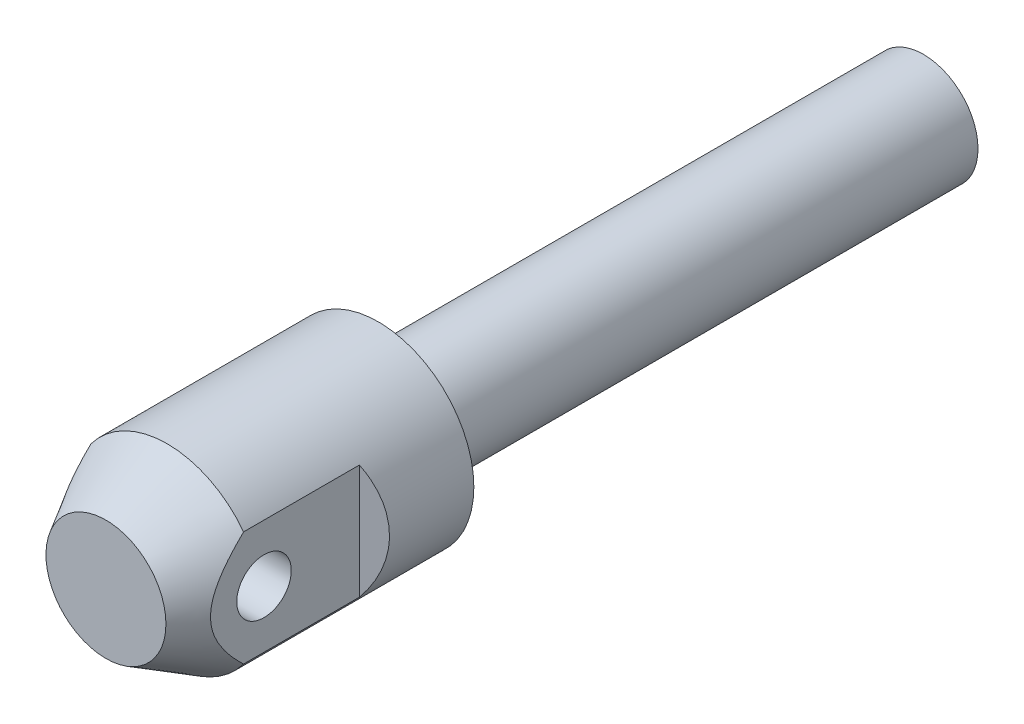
ISO-10303-21;
HEADER;
FILE_DESCRIPTION(('STEP AP214'),'2;1');
FILE_NAME('part.step','',(''),(''),'','','');
FILE_SCHEMA(('AUTOMOTIVE_DESIGN { 1 0 10303 214 1 1 1 1 }'));
ENDSEC;
DATA;
#1=APPLICATION_CONTEXT('core data for automotive mechanical design processes');
#2=APPLICATION_PROTOCOL_DEFINITION('international standard','automotive_design',2000,#1);
#3=PRODUCT_CONTEXT('',#1,'mechanical');
#4=PRODUCT('Part','Part','',(#3));
#5=PRODUCT_RELATED_PRODUCT_CATEGORY('part','',(#4));
#6=PRODUCT_DEFINITION_FORMATION('','',#4);
#7=PRODUCT_DEFINITION_CONTEXT('part definition',#1,'design');
#8=PRODUCT_DEFINITION('design','',#6,#7);
#9=PRODUCT_DEFINITION_SHAPE('','',#8);
#10=(LENGTH_UNIT() NAMED_UNIT(*) SI_UNIT(.MILLI.,.METRE.));
#11=(NAMED_UNIT(*) PLANE_ANGLE_UNIT() SI_UNIT($,.RADIAN.));
#12=(NAMED_UNIT(*) SI_UNIT($,.STERADIAN.) SOLID_ANGLE_UNIT());
#13=UNCERTAINTY_MEASURE_WITH_UNIT(LENGTH_MEASURE(1.E-05),#10,'distance_accuracy_value','');
#14=(GEOMETRIC_REPRESENTATION_CONTEXT(3) GLOBAL_UNCERTAINTY_ASSIGNED_CONTEXT((#13)) GLOBAL_UNIT_ASSIGNED_CONTEXT((#10,
#11,#12)) REPRESENTATION_CONTEXT('',''));
#15=CARTESIAN_POINT('',(0.,0.,0.));
#16=DIRECTION('',(0.,0.,1.));
#17=DIRECTION('',(1.,0.,0.));
#18=AXIS2_PLACEMENT_3D('',#15,#16,#17);
#19=CARTESIAN_POINT('',(0.,0.,20.));
#20=DIRECTION('',(0.,0.,1.));
#21=DIRECTION('',(1.,0.,0.));
#22=AXIS2_PLACEMENT_3D('',#19,#20,#21);
#23=CYLINDRICAL_SURFACE('',#22,4.);
#24=CARTESIAN_POINT('',(0.,0.,0.));
#25=DIRECTION('',(0.,0.,1.));
#26=DIRECTION('',(1.,0.,0.));
#27=AXIS2_PLACEMENT_3D('',#24,#25,#26);
#28=CIRCLE('',#27,4.);
#29=CARTESIAN_POINT('',(4.,0.,0.));
#30=VERTEX_POINT('',#29);
#31=EDGE_CURVE('E86',#30,#30,#28,.T.);
#32=ORIENTED_EDGE('',*,*,#31,.F.);
#33=EDGE_LOOP('',(#32));
#34=FACE_BOUND('',#33,.T.);
#35=CARTESIAN_POINT('',(0.,0.,-40.));
#36=DIRECTION('',(0.,0.,-1.));
#37=DIRECTION('',(-1.,0.,0.));
#38=AXIS2_PLACEMENT_3D('',#35,#36,#37);
#39=CIRCLE('',#38,4.);
#40=CARTESIAN_POINT('',(-4.,0.,-40.));
#41=VERTEX_POINT('',#40);
#42=EDGE_CURVE('E146',#41,#41,#39,.T.);
#43=ORIENTED_EDGE('',*,*,#42,.F.);
#44=EDGE_LOOP('',(#43));
#45=FACE_BOUND('',#44,.T.);
#46=ADVANCED_FACE('F14',(#34,#45),#23,.T.);
#47=CARTESIAN_POINT('',(0.,0.,20.));
#48=DIRECTION('',(0.,0.,1.));
#49=DIRECTION('',(1.,0.,0.));
#50=AXIS2_PLACEMENT_3D('',#47,#48,#49);
#51=CYLINDRICAL_SURFACE('',#50,7.);
#52=CARTESIAN_POINT('',(0.,0.,0.));
#53=DIRECTION('',(0.,0.,1.));
#54=DIRECTION('',(1.,0.,0.));
#55=AXIS2_PLACEMENT_3D('',#52,#53,#54);
#56=CIRCLE('',#55,7.);
#57=CARTESIAN_POINT('',(7.,0.,0.));
#58=VERTEX_POINT('',#57);
#59=EDGE_CURVE('E83',#58,#58,#56,.T.);
#60=ORIENTED_EDGE('',*,*,#59,.T.);
#61=EDGE_LOOP('',(#60));
#62=FACE_BOUND('',#61,.T.);
#63=CARTESIAN_POINT('',(0.,0.,15.5));
#64=DIRECTION('',(0.,0.,1.));
#65=DIRECTION('',(1.,0.,0.));
#66=AXIS2_PLACEMENT_3D('',#63,#64,#65);
#67=CIRCLE('',#66,7.);
#68=CARTESIAN_POINT('',(-5.6,-4.2,15.5));
#69=VERTEX_POINT('',#68);
#70=CARTESIAN_POINT('',(5.6,-4.2,15.5));
#71=VERTEX_POINT('',#70);
#72=EDGE_CURVE('E68',#69,#71,#67,.T.);
#73=ORIENTED_EDGE('',*,*,#72,.F.);
#74=DIRECTION('',(0.,0.,1.));
#75=VECTOR('',#74,1.);
#76=CARTESIAN_POINT('',(-5.6,-4.2,20.));
#77=LINE('',#76,#75);
#78=CARTESIAN_POINT('',(-5.6,-4.2,7.));
#79=VERTEX_POINT('',#78);
#80=EDGE_CURVE('E30',#69,#79,#77,.F.);
#81=ORIENTED_EDGE('',*,*,#80,.T.);
#82=CARTESIAN_POINT('',(0.,0.,10.2331615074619));
#83=DIRECTION('',(0.5,0.,-0.866025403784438));
#84=DIRECTION('',(0.866025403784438,0.,0.5));
#85=AXIS2_PLACEMENT_3D('',#82,#83,#84);
#86=ELLIPSE('',#85,8.08290376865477,7.);
#87=CARTESIAN_POINT('',(-5.6,4.2,7.));
#88=VERTEX_POINT('',#87);
#89=EDGE_CURVE('E9',#88,#79,#86,.F.);
#90=ORIENTED_EDGE('',*,*,#89,.F.);
#91=DIRECTION('',(0.,0.,1.));
#92=VECTOR('',#91,1.);
#93=CARTESIAN_POINT('',(-5.6,4.2,20.));
#94=LINE('',#93,#92);
#95=CARTESIAN_POINT('',(-5.6,4.2,15.5));
#96=VERTEX_POINT('',#95);
#97=EDGE_CURVE('E63',#88,#96,#94,.T.);
#98=ORIENTED_EDGE('',*,*,#97,.T.);
#99=CARTESIAN_POINT('',(5.6,4.2,15.5));
#100=VERTEX_POINT('',#99);
#101=EDGE_CURVE('E80',#100,#96,#67,.T.);
#102=ORIENTED_EDGE('',*,*,#101,.F.);
#103=DIRECTION('',(0.,0.,1.));
#104=VECTOR('',#103,1.);
#105=CARTESIAN_POINT('',(5.6,4.2,20.));
#106=LINE('',#105,#104);
#107=CARTESIAN_POINT('',(5.6,4.2,7.));
#108=VERTEX_POINT('',#107);
#109=EDGE_CURVE('E38',#108,#100,#106,.T.);
#110=ORIENTED_EDGE('',*,*,#109,.F.);
#111=CARTESIAN_POINT('',(0.,0.,10.2331615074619));
#112=DIRECTION('',(0.5,0.,0.866025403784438));
#113=DIRECTION('',(-0.866025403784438,0.,0.5));
#114=AXIS2_PLACEMENT_3D('',#111,#112,#113);
#115=ELLIPSE('',#114,8.08290376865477,7.);
#116=CARTESIAN_POINT('',(5.6,-4.2,7.));
#117=VERTEX_POINT('',#116);
#118=EDGE_CURVE('E97',#108,#117,#115,.F.);
#119=ORIENTED_EDGE('',*,*,#118,.T.);
#120=DIRECTION('',(0.,0.,1.));
#121=VECTOR('',#120,1.);
#122=CARTESIAN_POINT('',(5.6,-4.2,20.));
#123=LINE('',#122,#121);
#124=EDGE_CURVE('E75',#71,#117,#123,.F.);
#125=ORIENTED_EDGE('',*,*,#124,.F.);
#126=EDGE_LOOP('',(#73,#81,#90,#98,#102,#110,#119,#125));
#127=FACE_BOUND('',#126,.T.);
#128=ADVANCED_FACE('F66',(#62,#127),#51,.T.);
#129=CARTESIAN_POINT('',(0.,0.,20.));
#130=DIRECTION('',(0.,0.,-1.));
#131=DIRECTION('',(-1.,0.,0.));
#132=AXIS2_PLACEMENT_3D('',#129,#130,#131);
#133=CONICAL_SURFACE('',#132,4.40192378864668,0.523598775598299);
#134=CARTESIAN_POINT('',(0.,0.,20.));
#135=DIRECTION('',(0.,0.,1.));
#136=DIRECTION('',(1.,0.,0.));
#137=AXIS2_PLACEMENT_3D('',#134,#135,#136);
#138=CIRCLE('',#137,4.40192378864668);
#139=CARTESIAN_POINT('',(4.40192378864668,0.,20.));
#140=VERTEX_POINT('',#139);
#141=EDGE_CURVE('E77',#140,#140,#138,.T.);
#142=ORIENTED_EDGE('',*,*,#141,.F.);
#143=EDGE_LOOP('',(#142));
#144=FACE_BOUND('',#143,.T.);
#145=ORIENTED_EDGE('',*,*,#101,.T.);
#146=CARTESIAN_POINT('',(-5.6,-9.70053111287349,8.22381670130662));
#147=CARTESIAN_POINT('',(-5.6,-9.49292045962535,8.5351881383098));
#148=CARTESIAN_POINT('',(-5.6,-9.28419996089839,8.84582722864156));
#149=CARTESIAN_POINT('',(-5.6,-8.86396448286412,9.46526615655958));
#150=CARTESIAN_POINT('',(-5.6,-8.65244914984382,9.77406575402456));
#151=CARTESIAN_POINT('',(-5.6,-8.22496318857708,10.3910148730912));
#152=CARTESIAN_POINT('',(-5.6,-8.00897479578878,10.6991521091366));
#153=CARTESIAN_POINT('',(-5.6,-7.57288894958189,11.3124800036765));
#154=CARTESIAN_POINT('',(-5.6,-7.35279177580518,11.6176708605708));
#155=CARTESIAN_POINT('',(-5.6,-6.8924160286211,12.2447764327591));
#156=CARTESIAN_POINT('',(-5.6,-6.65177850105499,12.5664282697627));
#157=CARTESIAN_POINT('',(-5.6,-6.16295581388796,13.2039478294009));
#158=CARTESIAN_POINT('',(-5.6,-5.91477123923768,13.5198159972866));
#159=CARTESIAN_POINT('',(-5.6,-5.53523821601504,13.9871600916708));
#160=CARTESIAN_POINT('',(-5.6,-5.4076614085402,14.1416995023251));
#161=CARTESIAN_POINT('',(-5.6,-5.14958306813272,14.4483127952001));
#162=CARTESIAN_POINT('',(-5.6,-5.01908165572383,14.6003867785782));
#163=CARTESIAN_POINT('',(-5.6,-4.75469946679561,14.901472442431));
#164=CARTESIAN_POINT('',(-5.6,-4.62081999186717,15.0504852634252));
#165=CARTESIAN_POINT('',(-5.6,-4.34902251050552,15.3447710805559));
#166=CARTESIAN_POINT('',(-5.6,-4.21110494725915,15.4900444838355));
#167=CARTESIAN_POINT('',(-5.6,-3.99488885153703,15.7102406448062));
#168=CARTESIAN_POINT('',(-5.6,-3.91829370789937,15.7868367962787));
#169=CARTESIAN_POINT('',(-5.6,-3.76354640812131,15.9384393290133));
#170=CARTESIAN_POINT('',(-5.6,-3.68539423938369,16.0134456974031));
#171=CARTESIAN_POINT('',(-5.6,-3.44829101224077,16.2358094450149));
#172=CARTESIAN_POINT('',(-5.6,-3.28675601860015,16.380446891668));
#173=CARTESIAN_POINT('',(-5.6,-2.9565917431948,16.6588481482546));
#174=CARTESIAN_POINT('',(-5.6,-2.78802551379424,16.7926860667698));
#175=CARTESIAN_POINT('',(-5.6,-2.44109766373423,17.0468872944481));
#176=CARTESIAN_POINT('',(-5.6,-2.2627447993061,17.1672623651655));
#177=CARTESIAN_POINT('',(-5.6,-1.89093357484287,17.3913766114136));
#178=CARTESIAN_POINT('',(-5.6,-1.6972496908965,17.4947487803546));
#179=CARTESIAN_POINT('',(-5.6,-1.29711098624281,17.6736591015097));
#180=CARTESIAN_POINT('',(-5.6,-1.09067068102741,17.7492282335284));
#181=CARTESIAN_POINT('',(-5.6,-0.771838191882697,17.8349092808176));
#182=CARTESIAN_POINT('',(-5.6,-0.663134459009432,17.8589345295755));
#183=CARTESIAN_POINT('',(-5.6,-0.443873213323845,17.896280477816));
#184=CARTESIAN_POINT('',(-5.6,-0.333315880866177,17.909602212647));
#185=CARTESIAN_POINT('',(-5.6,-0.111521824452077,17.9248452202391));
#186=CARTESIAN_POINT('',(-5.6,-0.000285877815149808,17.926777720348));
#187=CARTESIAN_POINT('',(-5.6,0.221787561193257,17.9191711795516));
#188=CARTESIAN_POINT('',(-5.6,0.332625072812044,17.909632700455));
#189=CARTESIAN_POINT('',(-5.6,0.535708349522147,17.8819165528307));
#190=CARTESIAN_POINT('',(-5.6,0.628173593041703,17.8653066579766));
#191=CARTESIAN_POINT('',(-5.6,0.811513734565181,17.8248234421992));
#192=CARTESIAN_POINT('',(-5.6,0.902388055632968,17.8009475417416));
#193=CARTESIAN_POINT('',(-5.6,1.17202420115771,17.7194541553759));
#194=CARTESIAN_POINT('',(-5.6,1.34784342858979,17.6519643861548));
#195=CARTESIAN_POINT('',(-5.6,1.67656021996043,17.5029518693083));
#196=CARTESIAN_POINT('',(-5.6,1.83017318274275,17.422949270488));
#197=CARTESIAN_POINT('',(-5.6,2.1299433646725,17.2498642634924));
#198=CARTESIAN_POINT('',(-5.6,2.27609383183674,17.1567702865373));
#199=CARTESIAN_POINT('',(-5.6,2.56307158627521,16.9596775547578));
#200=CARTESIAN_POINT('',(-5.6,2.70382542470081,16.8555730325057));
#201=CARTESIAN_POINT('',(-5.6,2.91036000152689,16.6936954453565));
#202=CARTESIAN_POINT('',(-5.6,2.97842504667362,16.6387948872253));
#203=CARTESIAN_POINT('',(-5.6,3.11315281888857,16.5272996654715));
#204=CARTESIAN_POINT('',(-5.6,3.17981556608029,16.4707050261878));
#205=CARTESIAN_POINT('',(-5.6,3.37644695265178,16.2999211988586));
#206=CARTESIAN_POINT('',(-5.6,3.5045338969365,16.1835625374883));
#207=CARTESIAN_POINT('',(-5.6,3.75639629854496,15.9462534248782));
#208=CARTESIAN_POINT('',(-5.6,3.88017091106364,15.8253020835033));
#209=CARTESIAN_POINT('',(-5.6,4.12409751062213,15.5796482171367));
#210=CARTESIAN_POINT('',(-5.6,4.24424700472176,15.4549432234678));
#211=CARTESIAN_POINT('',(-5.6,4.481361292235,15.2025354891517));
#212=CARTESIAN_POINT('',(-5.6,4.59832585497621,15.0748325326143));
#213=CARTESIAN_POINT('',(-5.6,4.94596827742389,14.6870890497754));
#214=CARTESIAN_POINT('',(-5.6,5.17249967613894,14.423330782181));
#215=CARTESIAN_POINT('',(-5.6,5.61723114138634,13.8888834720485));
#216=CARTESIAN_POINT('',(-5.6,5.83543008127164,13.6181935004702));
#217=CARTESIAN_POINT('',(-5.6,6.14849079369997,13.2202386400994));
#218=CARTESIAN_POINT('',(-5.6,6.24592735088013,13.0949881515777));
#219=CARTESIAN_POINT('',(-5.6,6.43957396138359,12.8435571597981));
#220=CARTESIAN_POINT('',(-5.6,6.53578410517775,12.7173767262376));
#221=CARTESIAN_POINT('',(-5.6,6.8228015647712,12.3375613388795));
#222=CARTESIAN_POINT('',(-5.6,7.01196911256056,12.082686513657));
#223=CARTESIAN_POINT('',(-5.6,7.38506026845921,11.572617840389));
#224=CARTESIAN_POINT('',(-5.6,7.56901560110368,11.3174471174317));
#225=CARTESIAN_POINT('',(-5.6,7.93394479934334,10.8050609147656));
#226=CARTESIAN_POINT('',(-5.6,8.11491927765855,10.547845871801));
#227=CARTESIAN_POINT('',(-5.6,8.29470524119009,10.2898119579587));
#228=B_SPLINE_CURVE_WITH_KNOTS('',3,(#146,#147,#148,#149,#150,#151,#152,#153,#154,#155,#156,
#157,#158,#159,#160,#161,#162,#163,#164,#165,#166,#167,#168,#169,#170,#171,#172,#173,#174,#175,
#176,#177,#178,#179,#180,#181,#182,#183,#184,#185,#186,#187,#188,#189,#190,#191,#192,#193,#194,
#195,#196,#197,#198,#199,#200,#201,#202,#203,#204,#205,#206,#207,#208,#209,#210,#211,#212,#213,
#214,#215,#216,#217,#218,#219,#220,#221,#222,#223,#224,#225,#226,#227),.UNSPECIFIED.,.F.,.F.,(4,
2,2,2,2,2,2,2,2,2,2,2,2,2,2,2,2,2,2,2,2,2,2,2,2,2,2,2,2,2,2,2,2,2,2,2,2,2,2,2,4),(0.,
1.12272226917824,2.24558801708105,3.37445229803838,4.50324002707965,5.70827682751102,
6.91322046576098,7.5143780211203,8.11551084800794,8.71641548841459,9.31725442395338,
9.64220147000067,9.96715114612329,10.6173204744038,11.2625617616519,11.9072348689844,
12.5643833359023,13.2207973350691,13.5543256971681,13.8878217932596,14.2209890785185,
14.5541400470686,14.8356659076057,15.1172918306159,15.6804109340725,16.1992641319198,
16.7185787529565,17.2434351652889,17.5057534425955,17.7680679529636,18.2870550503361,
18.8061432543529,19.3255806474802,19.8450555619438,20.8878460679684,21.9307770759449,
22.4068321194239,22.8828518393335,23.835021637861,24.7786980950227,25.7221780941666),.UNSPECIFIED.);
#229=EDGE_CURVE('E23',#96,#69,#228,.F.);
#230=ORIENTED_EDGE('',*,*,#229,.T.);
#231=ORIENTED_EDGE('',*,*,#72,.T.);
#232=CARTESIAN_POINT('',(5.6,-9.70053111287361,8.22381670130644));
#233=CARTESIAN_POINT('',(5.6,-9.49292045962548,8.53518813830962));
#234=CARTESIAN_POINT('',(5.6,-9.28419996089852,8.84582722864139));
#235=CARTESIAN_POINT('',(5.6,-8.86396448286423,9.46526615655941));
#236=CARTESIAN_POINT('',(5.6,-8.65244914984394,9.77406575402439));
#237=CARTESIAN_POINT('',(5.6,-8.2249631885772,10.391014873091));
#238=CARTESIAN_POINT('',(5.6,-8.00897479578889,10.6991521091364));
#239=CARTESIAN_POINT('',(5.6,-7.572888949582,11.3124800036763));
#240=CARTESIAN_POINT('',(5.6,-7.35279177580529,11.6176708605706));
#241=CARTESIAN_POINT('',(5.6,-6.8924160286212,12.244776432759));
#242=CARTESIAN_POINT('',(5.6,-6.65177850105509,12.5664282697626));
#243=CARTESIAN_POINT('',(5.6,-6.16295581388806,13.2039478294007));
#244=CARTESIAN_POINT('',(5.6,-5.91477123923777,13.5198159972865));
#245=CARTESIAN_POINT('',(5.6,-5.53523821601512,13.9871600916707));
#246=CARTESIAN_POINT('',(5.6,-5.40766140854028,14.141699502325));
#247=CARTESIAN_POINT('',(5.6,-5.1495830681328,14.4483127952));
#248=CARTESIAN_POINT('',(5.6,-5.0190816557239,14.6003867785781));
#249=CARTESIAN_POINT('',(5.6,-4.75469946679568,14.9014724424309));
#250=CARTESIAN_POINT('',(5.6,-4.62081999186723,15.0504852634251));
#251=CARTESIAN_POINT('',(5.6,-4.3490225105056,15.3447710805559));
#252=CARTESIAN_POINT('',(5.6,-4.21110494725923,15.4900444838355));
#253=CARTESIAN_POINT('',(5.6,-3.99488885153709,15.7102406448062));
#254=CARTESIAN_POINT('',(5.6,-3.91829370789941,15.7868367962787));
#255=CARTESIAN_POINT('',(5.6,-3.76354640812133,15.9384393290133));
#256=CARTESIAN_POINT('',(5.6,-3.6853942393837,16.0134456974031));
#257=CARTESIAN_POINT('',(5.6,-3.44829101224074,16.2358094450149));
#258=CARTESIAN_POINT('',(5.6,-3.28675601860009,16.3804468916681));
#259=CARTESIAN_POINT('',(5.6,-2.95659174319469,16.6588481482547));
#260=CARTESIAN_POINT('',(5.6,-2.7880255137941,16.7926860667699));
#261=CARTESIAN_POINT('',(5.6,-2.44109766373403,17.0468872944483));
#262=CARTESIAN_POINT('',(5.6,-2.26274479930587,17.1672623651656));
#263=CARTESIAN_POINT('',(5.6,-1.89093357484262,17.3913766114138));
#264=CARTESIAN_POINT('',(5.6,-1.69724969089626,17.4947487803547));
#265=CARTESIAN_POINT('',(5.6,-1.29711098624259,17.6736591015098));
#266=CARTESIAN_POINT('',(5.6,-1.0906706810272,17.7492282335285));
#267=CARTESIAN_POINT('',(5.6,-0.771838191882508,17.8349092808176));
#268=CARTESIAN_POINT('',(5.6,-0.663134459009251,17.8589345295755));
#269=CARTESIAN_POINT('',(5.6,-0.443873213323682,17.896280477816));
#270=CARTESIAN_POINT('',(5.6,-0.333315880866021,17.909602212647));
#271=CARTESIAN_POINT('',(5.6,-0.111521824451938,17.9248452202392));
#272=CARTESIAN_POINT('',(5.6,-0.000285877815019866,17.926777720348));
#273=CARTESIAN_POINT('',(5.6,0.221787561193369,17.9191711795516));
#274=CARTESIAN_POINT('',(5.6,0.332625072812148,17.909632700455));
#275=CARTESIAN_POINT('',(5.6,0.535708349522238,17.8819165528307));
#276=CARTESIAN_POINT('',(5.6,0.62817359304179,17.8653066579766));
#277=CARTESIAN_POINT('',(5.6,0.811513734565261,17.8248234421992));
#278=CARTESIAN_POINT('',(5.6,0.902388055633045,17.8009475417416));
#279=CARTESIAN_POINT('',(5.6,1.17202420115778,17.7194541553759));
#280=CARTESIAN_POINT('',(5.6,1.34784342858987,17.6519643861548));
#281=CARTESIAN_POINT('',(5.6,1.6765602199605,17.5029518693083));
#282=CARTESIAN_POINT('',(5.6,1.83017318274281,17.422949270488));
#283=CARTESIAN_POINT('',(5.6,2.12994336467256,17.2498642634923));
#284=CARTESIAN_POINT('',(5.6,2.27609383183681,17.1567702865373));
#285=CARTESIAN_POINT('',(5.6,2.56307158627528,16.9596775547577));
#286=CARTESIAN_POINT('',(5.6,2.70382542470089,16.8555730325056));
#287=CARTESIAN_POINT('',(5.6,2.91036000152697,16.6936954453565));
#288=CARTESIAN_POINT('',(5.6,2.9784250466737,16.6387948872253));
#289=CARTESIAN_POINT('',(5.6,3.11315281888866,16.5272996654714));
#290=CARTESIAN_POINT('',(5.6,3.1798155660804,16.4707050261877));
#291=CARTESIAN_POINT('',(5.6,3.3764469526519,16.2999211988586));
#292=CARTESIAN_POINT('',(5.6,3.50453389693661,16.1835625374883));
#293=CARTESIAN_POINT('',(5.6,3.75639629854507,15.946253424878));
#294=CARTESIAN_POINT('',(5.6,3.88017091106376,15.8253020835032));
#295=CARTESIAN_POINT('',(5.6,4.12409751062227,15.5796482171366));
#296=CARTESIAN_POINT('',(5.6,4.24424700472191,15.4549432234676));
#297=CARTESIAN_POINT('',(5.6,4.48136129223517,15.2025354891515));
#298=CARTESIAN_POINT('',(5.6,4.59832585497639,15.0748325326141));
#299=CARTESIAN_POINT('',(5.6,4.94596827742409,14.6870890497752));
#300=CARTESIAN_POINT('',(5.6,5.17249967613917,14.4233307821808));
#301=CARTESIAN_POINT('',(5.6,5.61723114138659,13.8888834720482));
#302=CARTESIAN_POINT('',(5.6,5.83543008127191,13.6181935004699));
#303=CARTESIAN_POINT('',(5.6,6.14849079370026,13.2202386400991));
#304=CARTESIAN_POINT('',(5.6,6.24592735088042,13.0949881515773));
#305=CARTESIAN_POINT('',(5.6,6.43957396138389,12.8435571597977));
#306=CARTESIAN_POINT('',(5.6,6.53578410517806,12.7173767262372));
#307=CARTESIAN_POINT('',(5.6,6.82280156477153,12.3375613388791));
#308=CARTESIAN_POINT('',(5.6,7.01196911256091,12.0826865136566));
#309=CARTESIAN_POINT('',(5.6,7.38506026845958,11.5726178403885));
#310=CARTESIAN_POINT('',(5.6,7.56901560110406,11.3174471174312));
#311=CARTESIAN_POINT('',(5.6,7.93394479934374,10.805060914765));
#312=CARTESIAN_POINT('',(5.6,8.11491927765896,10.5478458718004));
#313=CARTESIAN_POINT('',(5.6,8.29470524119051,10.2898119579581));
#314=B_SPLINE_CURVE_WITH_KNOTS('',3,(#232,#233,#234,#235,#236,#237,#238,#239,#240,#241,#242,
#243,#244,#245,#246,#247,#248,#249,#250,#251,#252,#253,#254,#255,#256,#257,#258,#259,#260,#261,
#262,#263,#264,#265,#266,#267,#268,#269,#270,#271,#272,#273,#274,#275,#276,#277,#278,#279,#280,
#281,#282,#283,#284,#285,#286,#287,#288,#289,#290,#291,#292,#293,#294,#295,#296,#297,#298,#299,
#300,#301,#302,#303,#304,#305,#306,#307,#308,#309,#310,#311,#312,#313),.UNSPECIFIED.,.F.,.F.,(4,
2,2,2,2,2,2,2,2,2,2,2,2,2,2,2,2,2,2,2,2,2,2,2,2,2,2,2,2,2,2,2,2,2,2,2,2,2,2,2,4),(0.,
1.12272226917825,2.24558801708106,3.37445229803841,4.50324002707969,5.70827682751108,
6.91322046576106,7.51437802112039,8.11551084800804,8.71641548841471,9.3172544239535,
9.64220147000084,9.96715114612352,10.6173204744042,11.2625617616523,11.9072348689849,
12.5643833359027,13.2207973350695,13.5543256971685,13.8878217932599,14.2209890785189,
14.5541400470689,14.835665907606,15.1172918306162,15.6804109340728,16.1992641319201,
16.7185787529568,17.2434351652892,17.5057534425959,17.7680679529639,18.2870550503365,
18.8061432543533,19.3255806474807,19.8450555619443,20.887846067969,21.9307770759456,
22.4068321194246,22.8828518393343,23.8350216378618,24.7786980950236,25.7221780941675),.UNSPECIFIED.);
#315=EDGE_CURVE('E89',#100,#71,#314,.F.);
#316=ORIENTED_EDGE('',*,*,#315,.F.);
#317=EDGE_LOOP('',(#145,#230,#231,#316));
#318=FACE_BOUND('',#317,.T.);
#319=ADVANCED_FACE('F102',(#144,#318),#133,.T.);
#320=CARTESIAN_POINT('',(0.,4.40192378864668,20.));
#321=DIRECTION('',(0.,0.,-1.));
#322=DIRECTION('',(-1.,0.,0.));
#323=AXIS2_PLACEMENT_3D('',#320,#321,#322);
#324=PLANE('',#323);
#325=ORIENTED_EDGE('',*,*,#141,.T.);
#326=EDGE_LOOP('',(#325));
#327=FACE_BOUND('',#326,.T.);
#328=ADVANCED_FACE('F16',(#327),#324,.F.);
#329=CARTESIAN_POINT('',(0.,4.,0.));
#330=DIRECTION('',(0.,0.,1.));
#331=DIRECTION('',(1.,0.,0.));
#332=AXIS2_PLACEMENT_3D('',#329,#330,#331);
#333=PLANE('',#332);
#334=ORIENTED_EDGE('',*,*,#59,.F.);
#335=EDGE_LOOP('',(#334));
#336=FACE_BOUND('',#335,.T.);
#337=ORIENTED_EDGE('',*,*,#31,.T.);
#338=EDGE_LOOP('',(#337));
#339=FACE_BOUND('',#338,.T.);
#340=ADVANCED_FACE('F124',(#336,#339),#333,.F.);
#341=CARTESIAN_POINT('',(5.6,-15.,7.));
#342=DIRECTION('',(0.5,0.,0.866025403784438));
#343=DIRECTION('',(0.866025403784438,0.,-0.5));
#344=AXIS2_PLACEMENT_3D('',#341,#342,#343);
#345=PLANE('',#344);
#346=DIRECTION('',(0.,1.,0.));
#347=VECTOR('',#346,1.);
#348=CARTESIAN_POINT('',(5.6,-15.,7.));
#349=LINE('',#348,#347);
#350=EDGE_CURVE('E69',#117,#108,#349,.T.);
#351=ORIENTED_EDGE('',*,*,#350,.F.);
#352=ORIENTED_EDGE('',*,*,#118,.F.);
#353=EDGE_LOOP('',(#351,#352));
#354=FACE_BOUND('',#353,.T.);
#355=ADVANCED_FACE('F122',(#354),#345,.T.);
#356=CARTESIAN_POINT('',(5.6,-15.,7.));
#357=DIRECTION('',(-1.,0.,0.));
#358=DIRECTION('',(0.,0.,1.));
#359=AXIS2_PLACEMENT_3D('',#356,#357,#358);
#360=PLANE('',#359);
#361=CARTESIAN_POINT('',(5.6,0.,14.));
#362=DIRECTION('',(1.,0.,0.));
#363=DIRECTION('',(0.,0.,-1.));
#364=AXIS2_PLACEMENT_3D('',#361,#362,#363);
#365=CIRCLE('',#364,2.);
#366=CARTESIAN_POINT('',(5.6,0.,12.));
#367=VERTEX_POINT('',#366);
#368=EDGE_CURVE('E148',#367,#367,#365,.T.);
#369=ORIENTED_EDGE('',*,*,#368,.F.);
#370=EDGE_LOOP('',(#369));
#371=FACE_BOUND('',#370,.T.);
#372=ORIENTED_EDGE('',*,*,#124,.T.);
#373=ORIENTED_EDGE('',*,*,#350,.T.);
#374=ORIENTED_EDGE('',*,*,#109,.T.);
#375=ORIENTED_EDGE('',*,*,#315,.T.);
#376=EDGE_LOOP('',(#372,#373,#374,#375));
#377=FACE_BOUND('',#376,.T.);
#378=ADVANCED_FACE('F99',(#371,#377),#360,.F.);
#379=CARTESIAN_POINT('',(-5.6,-15.,7.));
#380=DIRECTION('',(-1.,0.,0.));
#381=DIRECTION('',(0.,0.,1.));
#382=AXIS2_PLACEMENT_3D('',#379,#380,#381);
#383=PLANE('',#382);
#384=CARTESIAN_POINT('',(-5.6,0.,14.));
#385=DIRECTION('',(-1.,0.,0.));
#386=DIRECTION('',(0.,0.,1.));
#387=AXIS2_PLACEMENT_3D('',#384,#385,#386);
#388=CIRCLE('',#387,2.);
#389=CARTESIAN_POINT('',(-5.6,0.,16.));
#390=VERTEX_POINT('',#389);
#391=EDGE_CURVE('E18',#390,#390,#388,.T.);
#392=ORIENTED_EDGE('',*,*,#391,.F.);
#393=EDGE_LOOP('',(#392));
#394=FACE_BOUND('',#393,.T.);
#395=ORIENTED_EDGE('',*,*,#229,.F.);
#396=ORIENTED_EDGE('',*,*,#97,.F.);
#397=DIRECTION('',(0.,1.,0.));
#398=VECTOR('',#397,1.);
#399=CARTESIAN_POINT('',(-5.6,-15.,7.));
#400=LINE('',#399,#398);
#401=EDGE_CURVE('E59',#79,#88,#400,.T.);
#402=ORIENTED_EDGE('',*,*,#401,.F.);
#403=ORIENTED_EDGE('',*,*,#80,.F.);
#404=EDGE_LOOP('',(#395,#396,#402,#403));
#405=FACE_BOUND('',#404,.T.);
#406=ADVANCED_FACE('F62',(#394,#405),#383,.T.);
#407=CARTESIAN_POINT('',(-5.6,-15.,7.));
#408=DIRECTION('',(0.5,0.,-0.866025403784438));
#409=DIRECTION('',(-0.866025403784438,0.,-0.5));
#410=AXIS2_PLACEMENT_3D('',#407,#408,#409);
#411=PLANE('',#410);
#412=ORIENTED_EDGE('',*,*,#89,.T.);
#413=ORIENTED_EDGE('',*,*,#401,.T.);
#414=EDGE_LOOP('',(#412,#413));
#415=FACE_BOUND('',#414,.T.);
#416=ADVANCED_FACE('F58',(#415),#411,.F.);
#417=CARTESIAN_POINT('',(-7.,0.,14.));
#418=DIRECTION('',(1.,0.,0.));
#419=DIRECTION('',(0.,0.,-1.));
#420=AXIS2_PLACEMENT_3D('',#417,#418,#419);
#421=CYLINDRICAL_SURFACE('',#420,2.);
#422=ORIENTED_EDGE('',*,*,#391,.T.);
#423=EDGE_LOOP('',(#422));
#424=FACE_BOUND('',#423,.T.);
#425=ORIENTED_EDGE('',*,*,#368,.T.);
#426=EDGE_LOOP('',(#425));
#427=FACE_BOUND('',#426,.T.);
#428=ADVANCED_FACE('F119',(#424,#427),#421,.F.);
#429=CARTESIAN_POINT('',(0.,0.,-40.));
#430=DIRECTION('',(0.,0.,-1.));
#431=DIRECTION('',(-1.,0.,0.));
#432=AXIS2_PLACEMENT_3D('',#429,#430,#431);
#433=PLANE('',#432);
#434=ORIENTED_EDGE('',*,*,#42,.T.);
#435=EDGE_LOOP('',(#434));
#436=FACE_BOUND('',#435,.T.);
#437=ADVANCED_FACE('F158',(#436),#433,.T.);
#438=CLOSED_SHELL('',(#46,#128,#319,#328,#340,#355,#378,#406,#416,#428,#437));
#439=MANIFOLD_SOLID_BREP('B1',#438);
#440=ADVANCED_BREP_SHAPE_REPRESENTATION('',(#18,#439),#14);
#441=SHAPE_DEFINITION_REPRESENTATION(#9,#440);
ENDSEC;
END-ISO-10303-21;
